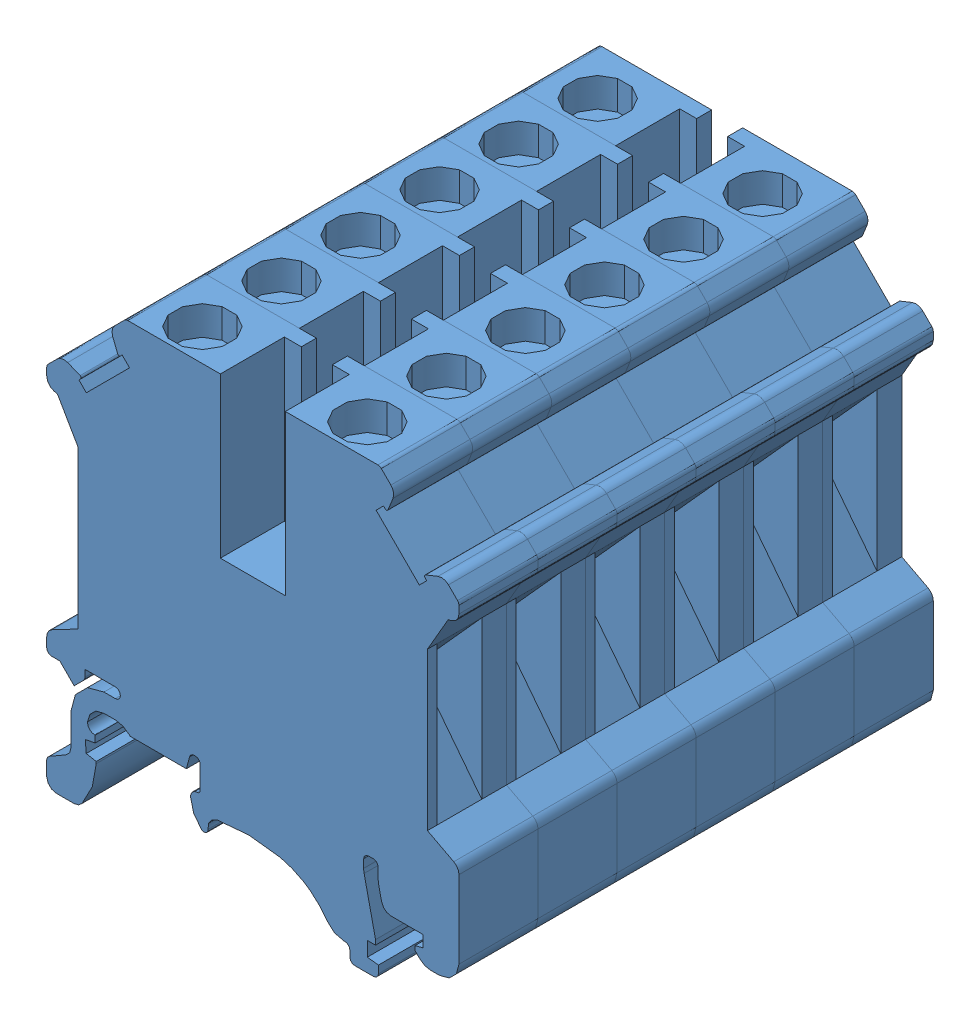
SolidWorks assembly UK6N- bank.SLDASM, configuration Default (file format 5000). Lengths in mm.
Overall size (42.5 45.9 48.9).
6 component instances, 1 part files, 15 mates.
Components (placement in the parent):
- 3004524_uk6n_select-1: 3004524_uk6n_select.sldprt [Default] at (17.5241 -10.9376 -1.8164) size (42.5 45.9 8.15)
- 3004524_uk6n_select-2: 3004524_uk6n_select.sldprt [Default] at (17.5241 -10.9376 6.3336) size (42.5 45.9 8.15)
- 3004524_uk6n_select-3: 3004524_uk6n_select.sldprt [Default] at (17.5241 -10.9376 14.4836) size (42.5 45.9 8.15)
- 3004524_uk6n_select-4: 3004524_uk6n_select.sldprt [Default] at (17.5241 -10.9376 22.6336) size (42.5 45.9 8.15)
- 3004524_uk6n_select-5: 3004524_uk6n_select.sldprt [Default] at (17.5241 -10.9376 30.7836) size (42.5 45.9 8.15)
- 3004524_uk6n_select-6: 3004524_uk6n_select.sldprt [Default] at (17.5241 -10.9376 38.9336) size (42.5 45.9 8.15)
Mates (geometry in assembly coordinates):
- Coincident1: coincident: plane of 3004524_uk6n_select-1 through (-21.2509 -17.2376 6.3336) normal (0 0 1); plane of 3004524_uk6n_select-2 through (21.2491 -17.2376 6.3336) normal (0 0 -1)
- Coincident2: coincident anti-aligned: plane of 3004524_uk6n_select-2; plane of 3004524_uk6n_select-3
- Coincident3: coincident aligned: plane of 3004524_uk6n_select-1 through (21.2491 -3.7431 6.3336) normal (1 0 0); plane of 3004524_uk6n_select-2
- Coincident4: coincident aligned: plane of 3004524_uk6n_select-2; plane of 3004524_uk6n_select-3
- Coincident5: coincident aligned: plane of 3004524_uk6n_select-1 through (1.5991 28.6624 6.3336) normal (0 1 0); plane of 3004524_uk6n_select-2
- Coincident6: coincident: plane of 3004524_uk6n_select-2; plane of 3004524_uk6n_select-3
- Coincident7: coincident: plane of assembly through (21.2491 -17.2376 22.6336) normal (0 0 -1)
- Coincident8: coincident: plane of 3004524_uk6n_select-3; plane of 3004524_uk6n_select-4
- Coincident9: coincident: plane of 3004524_uk6n_select-4; plane of 3004524_uk6n_select-5
- Coincident10: coincident: plane of 3004524_uk6n_select-4; plane of 3004524_uk6n_select-5
- Coincident11: coincident anti-aligned: plane of 3004524_uk6n_select-5; plane of 3004524_uk6n_select-6
- Coincident12: coincident aligned: plane of 3004524_uk6n_select-5; plane of 3004524_uk6n_select-6
- Coincident13: coincident aligned: plane of 3004524_uk6n_select-3 through (-12.8938 28.6624 14.4836) normal (0 1 0); plane of 3004524_uk6n_select-4
- Coincident14: coincident aligned: plane of 3004524_uk6n_select-4; plane of 3004524_uk6n_select-5
- Coincident15: coincident aligned: plane of 3004524_uk6n_select-5; plane of 3004524_uk6n_select-6
